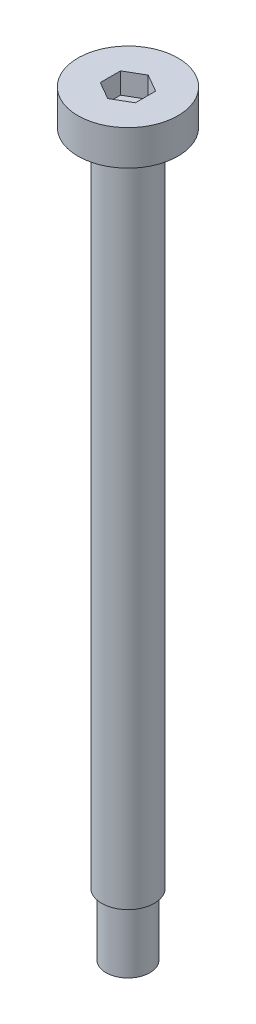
ISO-10303-21;
HEADER;
FILE_DESCRIPTION(('STEP AP214'),'2;1');
FILE_NAME('part.step','',(''),(''),'','','');
FILE_SCHEMA(('AUTOMOTIVE_DESIGN { 1 0 10303 214 1 1 1 1 }'));
ENDSEC;
DATA;
#1=APPLICATION_CONTEXT('core data for automotive mechanical design processes');
#2=APPLICATION_PROTOCOL_DEFINITION('international standard','automotive_design',2000,#1);
#3=PRODUCT_CONTEXT('',#1,'mechanical');
#4=PRODUCT('Part','Part','',(#3));
#5=PRODUCT_RELATED_PRODUCT_CATEGORY('part','',(#4));
#6=PRODUCT_DEFINITION_FORMATION('','',#4);
#7=PRODUCT_DEFINITION_CONTEXT('part definition',#1,'design');
#8=PRODUCT_DEFINITION('design','',#6,#7);
#9=PRODUCT_DEFINITION_SHAPE('','',#8);
#10=(LENGTH_UNIT() NAMED_UNIT(*) SI_UNIT(.MILLI.,.METRE.));
#11=(NAMED_UNIT(*) PLANE_ANGLE_UNIT() SI_UNIT($,.RADIAN.));
#12=(NAMED_UNIT(*) SI_UNIT($,.STERADIAN.) SOLID_ANGLE_UNIT());
#13=UNCERTAINTY_MEASURE_WITH_UNIT(LENGTH_MEASURE(1.E-05),#10,'distance_accuracy_value','');
#14=(GEOMETRIC_REPRESENTATION_CONTEXT(3) GLOBAL_UNCERTAINTY_ASSIGNED_CONTEXT((#13)) GLOBAL_UNIT_ASSIGNED_CONTEXT((#10,
#11,#12)) REPRESENTATION_CONTEXT('',''));
#15=CARTESIAN_POINT('',(0.,0.,0.));
#16=DIRECTION('',(0.,0.,1.));
#17=DIRECTION('',(1.,0.,0.));
#18=AXIS2_PLACEMENT_3D('',#15,#16,#17);
#19=CARTESIAN_POINT('',(0.,0.8,0.));
#20=DIRECTION('',(0.,-1.,0.));
#21=DIRECTION('',(0.,0.,-1.));
#22=AXIS2_PLACEMENT_3D('',#19,#20,#21);
#23=PLANE('',#22);
#24=DIRECTION('',(-0.866025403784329,0.,-0.50000000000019));
#25=VECTOR('',#24,1.);
#26=CARTESIAN_POINT('',(0.,0.8,-1.154700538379));
#27=LINE('',#26,#25);
#28=CARTESIAN_POINT('',(0.999999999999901,0.8,-0.577350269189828));
#29=VERTEX_POINT('',#28);
#30=CARTESIAN_POINT('',(0.,0.8,-1.15470053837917));
#31=VERTEX_POINT('',#30);
#32=EDGE_CURVE('E130',#29,#31,#27,.T.);
#33=ORIENTED_EDGE('',*,*,#32,.T.);
#34=DIRECTION('',(-0.866025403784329,0.,0.50000000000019));
#35=VECTOR('',#34,1.);
#36=CARTESIAN_POINT('',(-1.,0.8,-0.57735026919));
#37=LINE('',#36,#35);
#38=CARTESIAN_POINT('',(-1.,0.8,-0.57735026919));
#39=VERTEX_POINT('',#38);
#40=EDGE_CURVE('E134',#31,#39,#37,.T.);
#41=ORIENTED_EDGE('',*,*,#40,.T.);
#42=DIRECTION('',(0.,0.,1.));
#43=VECTOR('',#42,1.);
#44=CARTESIAN_POINT('',(-1.,0.8,0.57735026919));
#45=LINE('',#44,#43);
#46=CARTESIAN_POINT('',(-0.999999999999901,0.8,0.577350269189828));
#47=VERTEX_POINT('',#46);
#48=EDGE_CURVE('E66',#39,#47,#45,.T.);
#49=ORIENTED_EDGE('',*,*,#48,.T.);
#50=DIRECTION('',(0.866025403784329,0.,0.50000000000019));
#51=VECTOR('',#50,1.);
#52=CARTESIAN_POINT('',(0.,0.8,1.154700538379));
#53=LINE('',#52,#51);
#54=CARTESIAN_POINT('',(0.,0.8,1.15470053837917));
#55=VERTEX_POINT('',#54);
#56=EDGE_CURVE('E68',#47,#55,#53,.T.);
#57=ORIENTED_EDGE('',*,*,#56,.T.);
#58=DIRECTION('',(0.866025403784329,0.,-0.50000000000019));
#59=VECTOR('',#58,1.);
#60=CARTESIAN_POINT('',(1.,0.8,0.57735026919));
#61=LINE('',#60,#59);
#62=CARTESIAN_POINT('',(1.,0.8,0.57735026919));
#63=VERTEX_POINT('',#62);
#64=EDGE_CURVE('E70',#55,#63,#61,.T.);
#65=ORIENTED_EDGE('',*,*,#64,.T.);
#66=DIRECTION('',(0.,0.,-1.));
#67=VECTOR('',#66,1.);
#68=CARTESIAN_POINT('',(1.,0.8,-0.57735026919));
#69=LINE('',#68,#67);
#70=EDGE_CURVE('E126',#63,#29,#69,.T.);
#71=ORIENTED_EDGE('',*,*,#70,.T.);
#72=EDGE_LOOP('',(#33,#41,#49,#57,#65,#71));
#73=FACE_BOUND('',#72,.T.);
#74=ADVANCED_FACE('F15',(#73),#23,.F.);
#75=CARTESIAN_POINT('',(1.,0.8,0.57735026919));
#76=DIRECTION('',(0.50000000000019,0.,0.866025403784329));
#77=DIRECTION('',(0.866025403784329,0.,-0.50000000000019));
#78=AXIS2_PLACEMENT_3D('',#75,#76,#77);
#79=PLANE('',#78);
#80=DIRECTION('',(-0.866025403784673,0.,0.499999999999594));
#81=VECTOR('',#80,1.);
#82=CARTESIAN_POINT('',(1.,2.,0.57735026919));
#83=LINE('',#82,#81);
#84=CARTESIAN_POINT('',(1.,2.,0.57735026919));
#85=VERTEX_POINT('',#84);
#86=CARTESIAN_POINT('',(1.98909998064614E-13,2.,1.15470053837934));
#87=VERTEX_POINT('',#86);
#88=EDGE_CURVE('E122',#85,#87,#83,.T.);
#89=ORIENTED_EDGE('',*,*,#88,.F.);
#90=DIRECTION('',(0.,1.,0.));
#91=VECTOR('',#90,1.);
#92=CARTESIAN_POINT('',(1.,0.8,0.57735026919));
#93=LINE('',#92,#91);
#94=EDGE_CURVE('E81',#85,#63,#93,.F.);
#95=ORIENTED_EDGE('',*,*,#94,.T.);
#96=ORIENTED_EDGE('',*,*,#64,.F.);
#97=DIRECTION('',(0.,1.,0.));
#98=VECTOR('',#97,1.);
#99=CARTESIAN_POINT('',(0.,0.8,1.154700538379));
#100=LINE('',#99,#98);
#101=EDGE_CURVE('E75',#55,#87,#100,.T.);
#102=ORIENTED_EDGE('',*,*,#101,.T.);
#103=EDGE_LOOP('',(#89,#95,#96,#102));
#104=FACE_BOUND('',#103,.T.);
#105=ADVANCED_FACE('F78',(#104),#79,.F.);
#106=CARTESIAN_POINT('',(0.,0.8,1.154700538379));
#107=DIRECTION('',(-0.50000000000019,0.,0.866025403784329));
#108=DIRECTION('',(0.866025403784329,0.,0.50000000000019));
#109=AXIS2_PLACEMENT_3D('',#106,#107,#108);
#110=PLANE('',#109);
#111=DIRECTION('',(-0.866025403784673,0.,-0.499999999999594));
#112=VECTOR('',#111,1.);
#113=CARTESIAN_POINT('',(0.,2.,1.154700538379));
#114=LINE('',#113,#112);
#115=CARTESIAN_POINT('',(-0.999999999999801,2.,0.577350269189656));
#116=VERTEX_POINT('',#115);
#117=EDGE_CURVE('E86',#87,#116,#114,.T.);
#118=ORIENTED_EDGE('',*,*,#117,.F.);
#119=ORIENTED_EDGE('',*,*,#101,.F.);
#120=ORIENTED_EDGE('',*,*,#56,.F.);
#121=DIRECTION('',(0.,1.,0.));
#122=VECTOR('',#121,1.);
#123=CARTESIAN_POINT('',(-1.,0.8,0.57735026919));
#124=LINE('',#123,#122);
#125=EDGE_CURVE('E89',#47,#116,#124,.T.);
#126=ORIENTED_EDGE('',*,*,#125,.T.);
#127=EDGE_LOOP('',(#118,#119,#120,#126));
#128=FACE_BOUND('',#127,.T.);
#129=ADVANCED_FACE('F84',(#128),#110,.F.);
#130=CARTESIAN_POINT('',(-1.,0.8,0.57735026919));
#131=DIRECTION('',(-1.,0.,0.));
#132=DIRECTION('',(0.,0.,1.));
#133=AXIS2_PLACEMENT_3D('',#130,#131,#132);
#134=PLANE('',#133);
#135=DIRECTION('',(0.,0.,1.));
#136=VECTOR('',#135,1.);
#137=CARTESIAN_POINT('',(-1.,2.,0.));
#138=LINE('',#137,#136);
#139=CARTESIAN_POINT('',(-1.,2.,-0.57735026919));
#140=VERTEX_POINT('',#139);
#141=EDGE_CURVE('E118',#116,#140,#138,.F.);
#142=ORIENTED_EDGE('',*,*,#141,.F.);
#143=ORIENTED_EDGE('',*,*,#125,.F.);
#144=ORIENTED_EDGE('',*,*,#48,.F.);
#145=DIRECTION('',(0.,1.,0.));
#146=VECTOR('',#145,1.);
#147=CARTESIAN_POINT('',(-1.,0.8,-0.57735026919));
#148=LINE('',#147,#146);
#149=EDGE_CURVE('E132',#39,#140,#148,.T.);
#150=ORIENTED_EDGE('',*,*,#149,.T.);
#151=EDGE_LOOP('',(#142,#143,#144,#150));
#152=FACE_BOUND('',#151,.T.);
#153=ADVANCED_FACE('F137',(#152),#134,.F.);
#154=CARTESIAN_POINT('',(-1.,0.8,-0.57735026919));
#155=DIRECTION('',(-0.50000000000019,0.,-0.866025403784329));
#156=DIRECTION('',(-0.866025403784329,0.,0.50000000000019));
#157=AXIS2_PLACEMENT_3D('',#154,#155,#156);
#158=PLANE('',#157);
#159=DIRECTION('',(0.866025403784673,0.,-0.499999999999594));
#160=VECTOR('',#159,1.);
#161=CARTESIAN_POINT('',(-1.,2.,-0.57735026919));
#162=LINE('',#161,#160);
#163=CARTESIAN_POINT('',(-1.98949769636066E-13,2.,-1.15470053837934));
#164=VERTEX_POINT('',#163);
#165=EDGE_CURVE('E113',#140,#164,#162,.T.);
#166=ORIENTED_EDGE('',*,*,#165,.F.);
#167=ORIENTED_EDGE('',*,*,#149,.F.);
#168=ORIENTED_EDGE('',*,*,#40,.F.);
#169=DIRECTION('',(0.,1.,0.));
#170=VECTOR('',#169,1.);
#171=CARTESIAN_POINT('',(0.,0.8,-1.154700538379));
#172=LINE('',#171,#170);
#173=EDGE_CURVE('E128',#31,#164,#172,.T.);
#174=ORIENTED_EDGE('',*,*,#173,.T.);
#175=EDGE_LOOP('',(#166,#167,#168,#174));
#176=FACE_BOUND('',#175,.T.);
#177=ADVANCED_FACE('F148',(#176),#158,.F.);
#178=CARTESIAN_POINT('',(0.,0.8,-1.154700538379));
#179=DIRECTION('',(0.50000000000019,0.,-0.866025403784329));
#180=DIRECTION('',(-0.866025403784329,0.,-0.50000000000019));
#181=AXIS2_PLACEMENT_3D('',#178,#179,#180);
#182=PLANE('',#181);
#183=DIRECTION('',(0.866025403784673,0.,0.499999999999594));
#184=VECTOR('',#183,1.);
#185=CARTESIAN_POINT('',(0.,2.,-1.154700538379));
#186=LINE('',#185,#184);
#187=CARTESIAN_POINT('',(0.999999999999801,2.,-0.577350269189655));
#188=VERTEX_POINT('',#187);
#189=EDGE_CURVE('E109',#164,#188,#186,.T.);
#190=ORIENTED_EDGE('',*,*,#189,.F.);
#191=ORIENTED_EDGE('',*,*,#173,.F.);
#192=ORIENTED_EDGE('',*,*,#32,.F.);
#193=DIRECTION('',(0.,1.,0.));
#194=VECTOR('',#193,1.);
#195=CARTESIAN_POINT('',(1.,0.8,-0.57735026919));
#196=LINE('',#195,#194);
#197=EDGE_CURVE('E33',#29,#188,#196,.T.);
#198=ORIENTED_EDGE('',*,*,#197,.T.);
#199=EDGE_LOOP('',(#190,#191,#192,#198));
#200=FACE_BOUND('',#199,.T.);
#201=ADVANCED_FACE('F146',(#200),#182,.F.);
#202=CARTESIAN_POINT('',(1.,0.8,-0.57735026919));
#203=DIRECTION('',(1.,0.,0.));
#204=DIRECTION('',(0.,0.,-1.));
#205=AXIS2_PLACEMENT_3D('',#202,#203,#204);
#206=PLANE('',#205);
#207=DIRECTION('',(0.,0.,1.));
#208=VECTOR('',#207,1.);
#209=CARTESIAN_POINT('',(1.,2.,0.));
#210=LINE('',#209,#208);
#211=EDGE_CURVE('E105',#188,#85,#210,.T.);
#212=ORIENTED_EDGE('',*,*,#211,.F.);
#213=ORIENTED_EDGE('',*,*,#197,.F.);
#214=ORIENTED_EDGE('',*,*,#70,.F.);
#215=ORIENTED_EDGE('',*,*,#94,.F.);
#216=EDGE_LOOP('',(#212,#213,#214,#215));
#217=FACE_BOUND('',#216,.T.);
#218=ADVANCED_FACE('F143',(#217),#206,.F.);
#219=CARTESIAN_POINT('',(0.,2.,0.));
#220=DIRECTION('',(0.,1.,0.));
#221=DIRECTION('',(0.,0.,1.));
#222=AXIS2_PLACEMENT_3D('',#219,#220,#221);
#223=PLANE('',#222);
#224=ORIENTED_EDGE('',*,*,#189,.T.);
#225=ORIENTED_EDGE('',*,*,#211,.T.);
#226=ORIENTED_EDGE('',*,*,#88,.T.);
#227=ORIENTED_EDGE('',*,*,#117,.T.);
#228=ORIENTED_EDGE('',*,*,#141,.T.);
#229=ORIENTED_EDGE('',*,*,#165,.T.);
#230=EDGE_LOOP('',(#224,#225,#226,#227,#228,#229));
#231=FACE_BOUND('',#230,.T.);
#232=CARTESIAN_POINT('',(0.,2.,0.));
#233=DIRECTION('',(0.,1.,0.));
#234=DIRECTION('',(0.,0.,1.));
#235=AXIS2_PLACEMENT_3D('',#232,#233,#234);
#236=CIRCLE('',#235,2.85);
#237=CARTESIAN_POINT('',(0.,2.,2.85));
#238=VERTEX_POINT('',#237);
#239=EDGE_CURVE('E18',#238,#238,#236,.F.);
#240=ORIENTED_EDGE('',*,*,#239,.F.);
#241=EDGE_LOOP('',(#240));
#242=FACE_BOUND('',#241,.T.);
#243=ADVANCED_FACE('F140',(#231,#242),#223,.T.);
#244=CARTESIAN_POINT('',(0.,-41.1,0.));
#245=DIRECTION('',(0.,1.,0.));
#246=DIRECTION('',(0.,0.,1.));
#247=AXIS2_PLACEMENT_3D('',#244,#245,#246);
#248=PLANE('',#247);
#249=CARTESIAN_POINT('',(0.,-41.1,0.));
#250=DIRECTION('',(0.,1.,0.));
#251=DIRECTION('',(0.,0.,1.));
#252=AXIS2_PLACEMENT_3D('',#249,#250,#251);
#253=CIRCLE('',#252,1.25);
#254=CARTESIAN_POINT('',(0.,-41.1,1.25));
#255=VERTEX_POINT('',#254);
#256=EDGE_CURVE('E100',#255,#255,#253,.T.);
#257=ORIENTED_EDGE('',*,*,#256,.F.);
#258=EDGE_LOOP('',(#257));
#259=FACE_BOUND('',#258,.T.);
#260=ADVANCED_FACE('F180',(#259),#248,.F.);
#261=CARTESIAN_POINT('',(0.,0.,0.));
#262=DIRECTION('',(0.,1.,0.));
#263=DIRECTION('',(0.,0.,1.));
#264=AXIS2_PLACEMENT_3D('',#261,#262,#263);
#265=CYLINDRICAL_SURFACE('',#264,2.85);
#266=CARTESIAN_POINT('',(0.,0.,0.));
#267=DIRECTION('',(0.,1.,0.));
#268=DIRECTION('',(0.,0.,1.));
#269=AXIS2_PLACEMENT_3D('',#266,#267,#268);
#270=CIRCLE('',#269,2.85);
#271=CARTESIAN_POINT('',(0.,0.,2.85));
#272=VERTEX_POINT('',#271);
#273=EDGE_CURVE('E98',#272,#272,#270,.T.);
#274=ORIENTED_EDGE('',*,*,#273,.T.);
#275=EDGE_LOOP('',(#274));
#276=FACE_BOUND('',#275,.T.);
#277=ORIENTED_EDGE('',*,*,#239,.T.);
#278=EDGE_LOOP('',(#277));
#279=FACE_BOUND('',#278,.T.);
#280=ADVANCED_FACE('F177',(#276,#279),#265,.T.);
#281=CARTESIAN_POINT('',(0.,-41.1,0.));
#282=DIRECTION('',(0.,1.,0.));
#283=DIRECTION('',(0.,0.,1.));
#284=AXIS2_PLACEMENT_3D('',#281,#282,#283);
#285=CYLINDRICAL_SURFACE('',#284,1.25);
#286=ORIENTED_EDGE('',*,*,#256,.T.);
#287=EDGE_LOOP('',(#286));
#288=FACE_BOUND('',#287,.T.);
#289=CARTESIAN_POINT('',(0.,-37.55,0.));
#290=DIRECTION('',(0.,1.,0.));
#291=DIRECTION('',(0.,0.,1.));
#292=AXIS2_PLACEMENT_3D('',#289,#290,#291);
#293=CIRCLE('',#292,1.25);
#294=CARTESIAN_POINT('',(0.,-37.55,1.25));
#295=VERTEX_POINT('',#294);
#296=EDGE_CURVE('E95',#295,#295,#293,.F.);
#297=ORIENTED_EDGE('',*,*,#296,.T.);
#298=EDGE_LOOP('',(#297));
#299=FACE_BOUND('',#298,.T.);
#300=ADVANCED_FACE('F173',(#288,#299),#285,.T.);
#301=CARTESIAN_POINT('',(0.,0.,0.));
#302=DIRECTION('',(0.,1.,0.));
#303=DIRECTION('',(0.,0.,1.));
#304=AXIS2_PLACEMENT_3D('',#301,#302,#303);
#305=PLANE('',#304);
#306=CARTESIAN_POINT('',(0.,0.,0.));
#307=DIRECTION('',(0.,1.,0.));
#308=DIRECTION('',(0.,0.,1.));
#309=AXIS2_PLACEMENT_3D('',#306,#307,#308);
#310=CIRCLE('',#309,1.5);
#311=CARTESIAN_POINT('',(0.,0.,1.5));
#312=VERTEX_POINT('',#311);
#313=EDGE_CURVE('E24',#312,#312,#310,.F.);
#314=ORIENTED_EDGE('',*,*,#313,.F.);
#315=EDGE_LOOP('',(#314));
#316=FACE_BOUND('',#315,.T.);
#317=ORIENTED_EDGE('',*,*,#273,.F.);
#318=EDGE_LOOP('',(#317));
#319=FACE_BOUND('',#318,.T.);
#320=ADVANCED_FACE('F166',(#316,#319),#305,.F.);
#321=CARTESIAN_POINT('',(0.,-37.55,0.));
#322=DIRECTION('',(0.,1.,0.));
#323=DIRECTION('',(0.,0.,1.));
#324=AXIS2_PLACEMENT_3D('',#321,#322,#323);
#325=PLANE('',#324);
#326=ORIENTED_EDGE('',*,*,#296,.F.);
#327=EDGE_LOOP('',(#326));
#328=FACE_BOUND('',#327,.T.);
#329=CARTESIAN_POINT('',(0.,-37.55,0.));
#330=DIRECTION('',(0.,1.,0.));
#331=DIRECTION('',(0.,0.,1.));
#332=AXIS2_PLACEMENT_3D('',#329,#330,#331);
#333=CIRCLE('',#332,1.5);
#334=CARTESIAN_POINT('',(0.,-37.55,1.5));
#335=VERTEX_POINT('',#334);
#336=EDGE_CURVE('E9',#335,#335,#333,.T.);
#337=ORIENTED_EDGE('',*,*,#336,.F.);
#338=EDGE_LOOP('',(#337));
#339=FACE_BOUND('',#338,.T.);
#340=ADVANCED_FACE('F160',(#328,#339),#325,.F.);
#341=CARTESIAN_POINT('',(0.,-37.55,0.));
#342=DIRECTION('',(0.,1.,0.));
#343=DIRECTION('',(0.,0.,1.));
#344=AXIS2_PLACEMENT_3D('',#341,#342,#343);
#345=CYLINDRICAL_SURFACE('',#344,1.5);
#346=ORIENTED_EDGE('',*,*,#336,.T.);
#347=EDGE_LOOP('',(#346));
#348=FACE_BOUND('',#347,.T.);
#349=ORIENTED_EDGE('',*,*,#313,.T.);
#350=EDGE_LOOP('',(#349));
#351=FACE_BOUND('',#350,.T.);
#352=ADVANCED_FACE('F158',(#348,#351),#345,.T.);
#353=CLOSED_SHELL('',(#74,#105,#129,#153,#177,#201,#218,#243,#260,#280,#300,#320,#340,#352));
#354=MANIFOLD_SOLID_BREP('B1',#353);
#355=ADVANCED_BREP_SHAPE_REPRESENTATION('',(#18,#354),#14);
#356=SHAPE_DEFINITION_REPRESENTATION(#9,#355);
ENDSEC;
END-ISO-10303-21;
